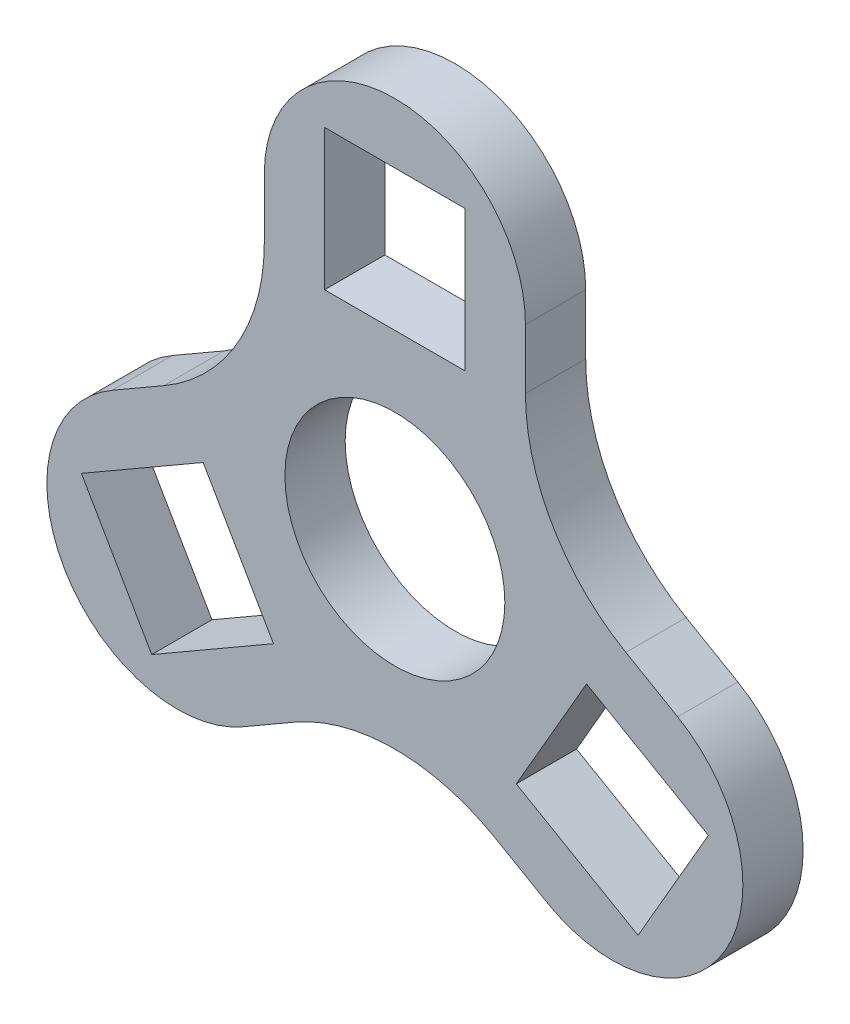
from build123d import *

# Parameters (mm, degrees)
ESQUISSE1_R        = 10.95
ESQUISSE1_W        = 14
ESQUISSE1_H        = 14
BOSS_EXTRU_1_DEPTH = 3
CONG_1_R           = 20


with BuildPart() as part:
    # Esquisse1 → Boss.-Extru.1 (new, symmetric)
    with BuildSketch(Plane.XY):
        with BuildLine():
            Line((13, 25), (13, 7.505553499))
            Line((13, 7.505553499), (28.150635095, -1.241669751))
            ThreePointArc((28.150635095, -1.241669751), (32.908965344, -19), (15.150635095, -23.758330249))
            Line((15.150635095, -23.758330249), (0, -15.011106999))
            Line((0, -15.011106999), (-15.150635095, -23.758330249))
            ThreePointArc((-15.150635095, -23.758330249), (-32.908965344, -19), (-28.150635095, -1.241669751))
            Line((-28.150635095, -1.241669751), (-13, 7.505553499))
            Line((-13, 7.505553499), (-13, 25))
            ThreePointArc((-13, 25), (0, 38), (13, 25))
        make_face()
        Circle(ESQUISSE1_R, mode=Mode.SUBTRACT)
        Polygon((24.212812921, -22.062177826), (12.088457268, -15.062177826), (19.088457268, -2.937822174), (31.212812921, -9.937822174), align=None, mode=Mode.SUBTRACT)
        with Locations((0, 25)):
            Rectangle(ESQUISSE1_W, ESQUISSE1_H, mode=Mode.SUBTRACT)
        Polygon((-31.212812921, -9.937822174), (-19.088457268, -2.937822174), (-12.088457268, -15.062177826), (-24.212812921, -22.062177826), align=None, mode=Mode.SUBTRACT)
    extrude(amount=BOSS_EXTRU_1_DEPTH, both=True)

    # Cong_1
    cong_1_edges = [part.edges().sort_by_distance(p)[0] for p in [
        (13, 7.505553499, 0),
        (0, -15.011106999, 0),
        (-13, 7.505553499, 0),
    ]]
    fillet(cong_1_edges, radius=CONG_1_R)


solid = part.part
